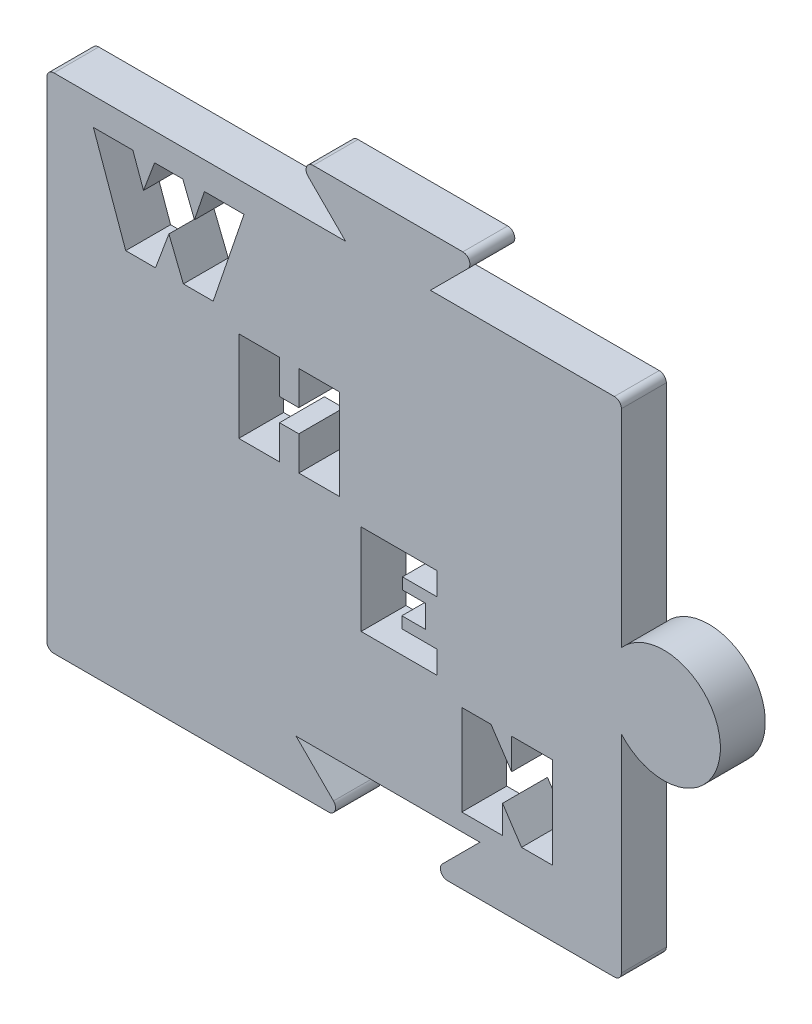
from build123d import *

# Parameters (mm, degrees)
BOSS_EXTRUDE1_DEPTH = 3.175
CUT_EXTRUDE3_DEPTH  = 62.687387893
FILLET1_R           = 0.5


with BuildPart() as part:
    # Sketch1 → Boss-Extrude1 (new body)
    with BuildSketch(Plane.XY):
        with BuildLine():
            Line((40.64, 35.56), (40.64, 20.425751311))
            ThreePointArc((40.64, 20.425751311), (47.64, 17.78), (40.64, 15.134248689))
            Line((40.64, 15.134248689), (40.64, 0))
            Line((40.64, 0), (27.13, 0))
            Line((27.13, 0), (30.63, 3.5))
            Line((30.63, 3.5), (17.63, 3.5))
            Line((17.63, 3.5), (21.13, 0))
            Line((21.13, 0), (0, 0))
            Line((0, 0), (0, 35.56))
            Line((0, 35.56), (21.13, 35.56))
            Line((21.13, 35.56), (17.63, 39.06))
            Line((17.63, 39.06), (30.63, 39.06))
            Line((30.63, 39.06), (27.13, 35.56))
            Line((27.13, 35.56), (40.64, 35.56))
        make_face()
    extrude(amount=BOSS_EXTRUDE1_DEPTH)

    # Sketch4 → Cut-Extrude3 (cut, through all)
    with BuildSketch(Plane.XY.offset(3.175)):
        Polygon((7.685311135, 27.210722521), (5.578971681, 27.210722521), (3.293662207, 33.618600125), (6.08709635, 33.618600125), (6.838019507, 31.527279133), (7.626488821, 33.618600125), (9.61393211, 33.618600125), (10.441199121, 31.527279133), (11.148318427, 33.618600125), (13.946758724, 33.618600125), (11.767830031, 27.210722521), (9.656484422, 27.210722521), (8.635228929, 29.762609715), align=None)
        Polygon((16.459522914, 19.710722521), (13.575977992, 19.710722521), (13.575977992, 26.118600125), (16.459522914, 26.118600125), (16.459522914, 23.715646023), (17.821196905, 23.715646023), (17.821196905, 26.118600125), (20.704741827, 26.118600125), (20.704741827, 19.710722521), (17.821196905, 19.710722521), (17.821196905, 22.113676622), (16.459522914, 22.113676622), align=None)
        Polygon((27.593544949, 13.812691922), (27.593544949, 12.210722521), (22.226947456, 12.210722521), (22.226947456, 18.618600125), (27.593544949, 18.618600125), (27.593544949, 17.016630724), (25.150541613, 17.016630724), (25.150541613, 16.215646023), (26.792560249, 16.215646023), (26.792560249, 14.613676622), (25.110492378, 14.613676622), (25.110492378, 13.812691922), align=None)
        Polygon((35.757951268, 4.660660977), (33.574016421, 4.660660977), (32.233618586, 6.691908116), (32.233618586, 4.710722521), (29.350073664, 4.710722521), (29.350073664, 11.118600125), (31.413860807, 11.118600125), (32.874406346, 8.939671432), (32.874406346, 11.118600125), (35.757951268, 11.118600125), align=None)
    extrude(amount=-CUT_EXTRUDE3_DEPTH, mode=Mode.SUBTRACT)

    # Fillet1
    fillet1_edges = [part.edges().sort_by_distance(p)[0] for p in [
        (0, 35.56, 1.5875),
        (17.63, 39.06, 1.5875),
        (30.63, 39.06, 1.5875),
        (40.64, 35.56, 1.5875),
        (40.64, 0, 1.5875),
        (27.13, 0, 1.5875),
        (21.13, 0, 1.5875),
        (0, 0, 1.5875),
    ]]
    fillet(fillet1_edges, radius=FILLET1_R)


solid = part.part
